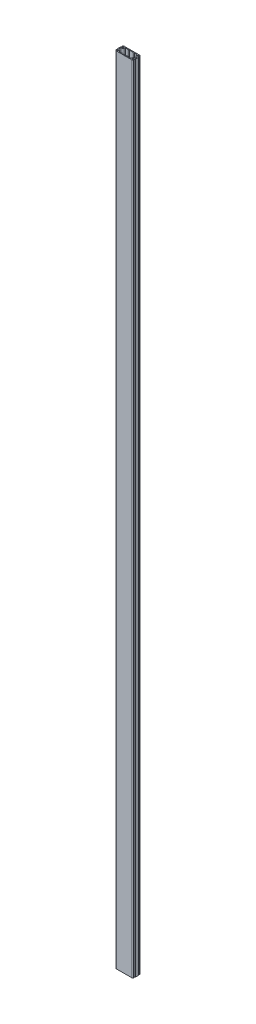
from build123d import *

# Parameters (mm, degrees)
SALIENTE_EXTRUIR1_DEPTH = 7940


with BuildPart() as part:
    # Croquis2 → Saliente-Extruir1 (new body)
    with BuildSketch(Plane(origin=(0, 0, 0), x_dir=(1, 0, 0), z_dir=(0, 1, 0))):
        with BuildLine():
            Line((90, -15.820430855), (90, 15.820430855))
            ThreePointArc((90, 15.820430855), (86.377431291, 21.479059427), (79.722019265, 20.557879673))
            ThreePointArc((79.722019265, 20.557879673), (69.104845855, 26.662756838), (81.19143785, 28.639671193))
            ThreePointArc((81.19143785, 28.639671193), (86.625966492, 27.069353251), (88.196284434, 32.503881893))
            ThreePointArc((88.196284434, 32.503881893), (82.872032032, 37.986118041), (75.5, 40))
            Line((75.5, 40), (-75.5, 40))
            ThreePointArc((-75.5, 40), (-82.872032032, 37.986118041), (-88.196284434, 32.503881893))
            ThreePointArc((-88.196284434, 32.503881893), (-86.625966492, 27.069353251), (-81.19143785, 28.639671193))
            ThreePointArc((-81.19143785, 28.639671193), (-69.104845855, 26.662756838), (-79.722019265, 20.557879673))
            ThreePointArc((-79.722019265, 20.557879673), (-86.377431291, 21.479059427), (-90, 15.820430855))
            Line((-90, 15.820430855), (-90, -15.820430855))
            ThreePointArc((-90, -15.820430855), (-86.377431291, -21.479059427), (-79.722019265, -20.557879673))
            ThreePointArc((-79.722019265, -20.557879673), (-69.104845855, -26.662756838), (-81.19143785, -28.639671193))
            ThreePointArc((-81.19143785, -28.639671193), (-86.625966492, -27.069353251), (-88.196284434, -32.503881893))
            ThreePointArc((-88.196284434, -32.503881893), (-82.872032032, -37.986118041), (-75.5, -40))
            Line((-75.5, -40), (75.5, -40))
            ThreePointArc((75.5, -40), (82.872032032, -37.986118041), (88.196284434, -32.503881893))
            ThreePointArc((88.196284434, -32.503881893), (86.625966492, -27.069353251), (81.19143785, -28.639671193))
            ThreePointArc((81.19143785, -28.639671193), (69.104845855, -26.662756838), (79.722019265, -20.557879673))
            ThreePointArc((79.722019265, -20.557879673), (86.377431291, -21.479059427), (90, -15.820430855))
        make_face()
        with BuildLine():
            Line((-17.482701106, 32), (17.482701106, 32))
            Line((17.482701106, 32), (20, 29))
            Line((20, 29), (30, 29))
            Line((30, 29), (32.517298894, 32))
            Line((32.517298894, 32), (54.5, 32))
            ThreePointArc((54.5, 32), (59.096194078, 30.096194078), (61, 25.5))
            ThreePointArc((61, 25.5), (65.246951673, 15.246951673), (75.5, 11))
            ThreePointArc((75.5, 11), (80.096194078, 9.096194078), (82, 4.5))
            Line((82, 4.5), (82, -4.5))
            ThreePointArc((82, -4.5), (80.096194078, -9.096194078), (75.5, -11))
            ThreePointArc((75.5, -11), (65.246951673, -15.246951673), (61, -25.5))
            ThreePointArc((61, -25.5), (59.096194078, -30.096194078), (54.5, -32))
            Line((54.5, -32), (32.517298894, -32))
            Line((32.517298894, -32), (30, -29))
            Line((30, -29), (20, -29))
            Line((20, -29), (17.482701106, -32))
            Line((17.482701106, -32), (-17.482701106, -32))
            Line((-17.482701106, -32), (-20, -29))
            Line((-20, -29), (-30, -29))
            Line((-30, -29), (-32.517298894, -32))
            Line((-32.517298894, -32), (-54.5, -32))
            ThreePointArc((-54.5, -32), (-59.096194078, -30.096194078), (-61, -25.5))
            ThreePointArc((-61, -25.5), (-65.246951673, -15.246951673), (-75.5, -11))
            ThreePointArc((-75.5, -11), (-80.096194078, -9.096194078), (-82, -4.5))
            Line((-82, -4.5), (-82, 4.5))
            ThreePointArc((-82, 4.5), (-80.096194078, 9.096194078), (-75.5, 11))
            ThreePointArc((-75.5, 11), (-65.246951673, 15.246951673), (-61, 25.5))
            ThreePointArc((-61, 25.5), (-59.096194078, 30.096194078), (-54.5, 32))
            Line((-54.5, 32), (-32.517298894, 32))
            Line((-32.517298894, 32), (-30, 29))
            Line((-30, 29), (-20, 29))
            Line((-20, 29), (-17.482701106, 32))
        make_face(mode=Mode.SUBTRACT)
    extrude(amount=SALIENTE_EXTRUIR1_DEPTH)


solid = part.part
